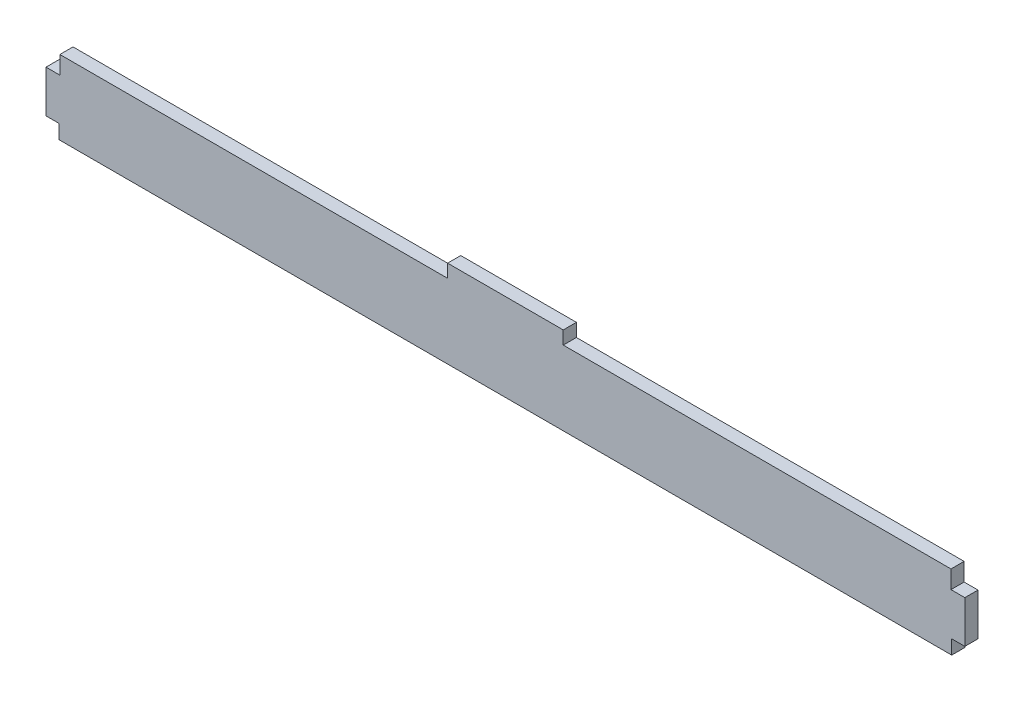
ISO-10303-21;
HEADER;
FILE_DESCRIPTION(('STEP AP214'),'2;1');
FILE_NAME('part.step','',(''),(''),'','','');
FILE_SCHEMA(('AUTOMOTIVE_DESIGN { 1 0 10303 214 1 1 1 1 }'));
ENDSEC;
DATA;
#1=APPLICATION_CONTEXT('core data for automotive mechanical design processes');
#2=APPLICATION_PROTOCOL_DEFINITION('international standard','automotive_design',2000,#1);
#3=PRODUCT_CONTEXT('',#1,'mechanical');
#4=PRODUCT('Part','Part','',(#3));
#5=PRODUCT_RELATED_PRODUCT_CATEGORY('part','',(#4));
#6=PRODUCT_DEFINITION_FORMATION('','',#4);
#7=PRODUCT_DEFINITION_CONTEXT('part definition',#1,'design');
#8=PRODUCT_DEFINITION('design','',#6,#7);
#9=PRODUCT_DEFINITION_SHAPE('','',#8);
#10=(LENGTH_UNIT() NAMED_UNIT(*) SI_UNIT(.MILLI.,.METRE.));
#11=(NAMED_UNIT(*) PLANE_ANGLE_UNIT() SI_UNIT($,.RADIAN.));
#12=(NAMED_UNIT(*) SI_UNIT($,.STERADIAN.) SOLID_ANGLE_UNIT());
#13=UNCERTAINTY_MEASURE_WITH_UNIT(LENGTH_MEASURE(1.E-05),#10,'distance_accuracy_value','');
#14=(GEOMETRIC_REPRESENTATION_CONTEXT(3) GLOBAL_UNCERTAINTY_ASSIGNED_CONTEXT((#13)) GLOBAL_UNIT_ASSIGNED_CONTEXT((#10,
#11,#12)) REPRESENTATION_CONTEXT('',''));
#15=CARTESIAN_POINT('',(0.,0.,0.));
#16=DIRECTION('',(0.,0.,1.));
#17=DIRECTION('',(1.,0.,0.));
#18=AXIS2_PLACEMENT_3D('',#15,#16,#17);
#19=CARTESIAN_POINT('',(111.159880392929,-1.524,1.524));
#20=DIRECTION('',(0.,-1.,0.));
#21=DIRECTION('',(1.,0.,0.));
#22=AXIS2_PLACEMENT_3D('',#19,#20,#21);
#23=PLANE('',#22);
#24=DIRECTION('',(-1.,0.,0.));
#25=VECTOR('',#24,1.);
#26=CARTESIAN_POINT('',(111.159880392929,-1.524,0.));
#27=LINE('',#26,#25);
#28=CARTESIAN_POINT('',(111.159880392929,-1.524,0.));
#29=VERTEX_POINT('',#28);
#30=CARTESIAN_POINT('',(66.2139326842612,-1.524,0.));
#31=VERTEX_POINT('',#30);
#32=EDGE_CURVE('E180',#29,#31,#27,.T.);
#33=ORIENTED_EDGE('',*,*,#32,.T.);
#34=DIRECTION('',(0.,0.,-1.));
#35=VECTOR('',#34,1.);
#36=CARTESIAN_POINT('',(66.2139326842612,-1.524,1.524));
#37=LINE('',#36,#35);
#38=CARTESIAN_POINT('',(66.2139326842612,-1.524,1.524));
#39=VERTEX_POINT('',#38);
#40=EDGE_CURVE('E11',#39,#31,#37,.T.);
#41=ORIENTED_EDGE('',*,*,#40,.F.);
#42=DIRECTION('',(-1.,0.,0.));
#43=VECTOR('',#42,1.);
#44=CARTESIAN_POINT('',(111.159880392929,-1.524,1.524));
#45=LINE('',#44,#43);
#46=CARTESIAN_POINT('',(111.159880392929,-1.524,1.524));
#47=VERTEX_POINT('',#46);
#48=EDGE_CURVE('E210',#47,#39,#45,.T.);
#49=ORIENTED_EDGE('',*,*,#48,.F.);
#50=DIRECTION('',(0.,0.,-1.));
#51=VECTOR('',#50,1.);
#52=CARTESIAN_POINT('',(111.159880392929,-1.524,1.524));
#53=LINE('',#52,#51);
#54=EDGE_CURVE('E176',#47,#29,#53,.T.);
#55=ORIENTED_EDGE('',*,*,#54,.T.);
#56=EDGE_LOOP('',(#33,#41,#49,#55));
#57=FACE_BOUND('',#56,.T.);
#58=ADVANCED_FACE('F36',(#57),#23,.F.);
#59=CARTESIAN_POINT('',(66.2139326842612,-1.524,1.524));
#60=DIRECTION('',(1.,0.,0.));
#61=DIRECTION('',(0.,0.,-1.));
#62=AXIS2_PLACEMENT_3D('',#59,#60,#61);
#63=PLANE('',#62);
#64=DIRECTION('',(0.,-1.,0.));
#65=VECTOR('',#64,1.);
#66=CARTESIAN_POINT('',(66.2139326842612,-1.524,0.));
#67=LINE('',#66,#65);
#68=CARTESIAN_POINT('',(66.2139326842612,-3.59954891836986,0.));
#69=VERTEX_POINT('',#68);
#70=EDGE_CURVE('E183',#31,#69,#67,.T.);
#71=ORIENTED_EDGE('',*,*,#70,.T.);
#72=DIRECTION('',(0.,0.,-1.));
#73=VECTOR('',#72,1.);
#74=CARTESIAN_POINT('',(66.2139326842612,-3.59954891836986,1.524));
#75=LINE('',#74,#73);
#76=CARTESIAN_POINT('',(66.2139326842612,-3.59954891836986,1.524));
#77=VERTEX_POINT('',#76);
#78=EDGE_CURVE('E44',#77,#69,#75,.T.);
#79=ORIENTED_EDGE('',*,*,#78,.F.);
#80=DIRECTION('',(0.,-1.,0.));
#81=VECTOR('',#80,1.);
#82=CARTESIAN_POINT('',(66.2139326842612,-1.524,1.524));
#83=LINE('',#82,#81);
#84=EDGE_CURVE('E119',#39,#77,#83,.T.);
#85=ORIENTED_EDGE('',*,*,#84,.F.);
#86=ORIENTED_EDGE('',*,*,#40,.T.);
#87=EDGE_LOOP('',(#71,#79,#85,#86));
#88=FACE_BOUND('',#87,.T.);
#89=ADVANCED_FACE('F308',(#88),#63,.F.);
#90=CARTESIAN_POINT('',(66.2139326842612,-3.59954891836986,1.524));
#91=DIRECTION('',(0.,-1.,0.));
#92=DIRECTION('',(0.,0.,-1.));
#93=AXIS2_PLACEMENT_3D('',#90,#91,#92);
#94=PLANE('',#93);
#95=DIRECTION('',(-1.,0.,0.));
#96=VECTOR('',#95,1.);
#97=CARTESIAN_POINT('',(66.2139326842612,-3.59954891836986,0.));
#98=LINE('',#97,#96);
#99=CARTESIAN_POINT('',(64.6041495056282,-3.59954891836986,0.));
#100=VERTEX_POINT('',#99);
#101=EDGE_CURVE('E185',#69,#100,#98,.T.);
#102=ORIENTED_EDGE('',*,*,#101,.T.);
#103=DIRECTION('',(0.,0.,-1.));
#104=VECTOR('',#103,1.);
#105=CARTESIAN_POINT('',(64.6041495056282,-3.59954891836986,1.524));
#106=LINE('',#105,#104);
#107=CARTESIAN_POINT('',(64.6041495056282,-3.59954891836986,1.524));
#108=VERTEX_POINT('',#107);
#109=EDGE_CURVE('E241',#108,#100,#106,.T.);
#110=ORIENTED_EDGE('',*,*,#109,.F.);
#111=DIRECTION('',(-1.,0.,0.));
#112=VECTOR('',#111,1.);
#113=CARTESIAN_POINT('',(66.2139326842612,-3.59954891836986,1.524));
#114=LINE('',#113,#112);
#115=EDGE_CURVE('E249',#77,#108,#114,.T.);
#116=ORIENTED_EDGE('',*,*,#115,.F.);
#117=ORIENTED_EDGE('',*,*,#78,.T.);
#118=EDGE_LOOP('',(#102,#110,#116,#117));
#119=FACE_BOUND('',#118,.T.);
#120=ADVANCED_FACE('F247',(#119),#94,.F.);
#121=CARTESIAN_POINT('',(64.6041495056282,-3.59954891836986,1.524));
#122=DIRECTION('',(1.,0.,0.));
#123=DIRECTION('',(0.,1.,0.));
#124=AXIS2_PLACEMENT_3D('',#121,#122,#123);
#125=PLANE('',#124);
#126=DIRECTION('',(0.,-1.,0.));
#127=VECTOR('',#126,1.);
#128=CARTESIAN_POINT('',(64.6041495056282,-3.59954891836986,0.));
#129=LINE('',#128,#127);
#130=CARTESIAN_POINT('',(64.6041495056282,-8.49527832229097,0.));
#131=VERTEX_POINT('',#130);
#132=EDGE_CURVE('E187',#100,#131,#129,.T.);
#133=ORIENTED_EDGE('',*,*,#132,.T.);
#134=DIRECTION('',(0.,0.,-1.));
#135=VECTOR('',#134,1.);
#136=CARTESIAN_POINT('',(64.6041495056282,-8.49527832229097,1.524));
#137=LINE('',#136,#135);
#138=CARTESIAN_POINT('',(64.6041495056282,-8.49527832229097,1.524));
#139=VERTEX_POINT('',#138);
#140=EDGE_CURVE('E238',#139,#131,#137,.T.);
#141=ORIENTED_EDGE('',*,*,#140,.F.);
#142=DIRECTION('',(0.,-1.,0.));
#143=VECTOR('',#142,1.);
#144=CARTESIAN_POINT('',(64.6041495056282,-3.59954891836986,1.524));
#145=LINE('',#144,#143);
#146=EDGE_CURVE('E267',#108,#139,#145,.T.);
#147=ORIENTED_EDGE('',*,*,#146,.F.);
#148=ORIENTED_EDGE('',*,*,#109,.T.);
#149=EDGE_LOOP('',(#133,#141,#147,#148));
#150=FACE_BOUND('',#149,.T.);
#151=ADVANCED_FACE('F258',(#150),#125,.F.);
#152=CARTESIAN_POINT('',(64.6041495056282,-8.49527832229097,1.524));
#153=DIRECTION('',(0.,1.,0.));
#154=DIRECTION('',(0.,0.,1.));
#155=AXIS2_PLACEMENT_3D('',#152,#153,#154);
#156=PLANE('',#155);
#157=DIRECTION('',(1.,0.,0.));
#158=VECTOR('',#157,1.);
#159=CARTESIAN_POINT('',(64.6041495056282,-8.49527832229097,0.));
#160=LINE('',#159,#158);
#161=CARTESIAN_POINT('',(66.1281495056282,-8.49527832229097,0.));
#162=VERTEX_POINT('',#161);
#163=EDGE_CURVE('E189',#131,#162,#160,.T.);
#164=ORIENTED_EDGE('',*,*,#163,.T.);
#165=DIRECTION('',(0.,0.,-1.));
#166=VECTOR('',#165,1.);
#167=CARTESIAN_POINT('',(66.1281495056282,-8.49527832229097,1.524));
#168=LINE('',#167,#166);
#169=CARTESIAN_POINT('',(66.1281495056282,-8.49527832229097,1.524));
#170=VERTEX_POINT('',#169);
#171=EDGE_CURVE('E235',#170,#162,#168,.T.);
#172=ORIENTED_EDGE('',*,*,#171,.F.);
#173=DIRECTION('',(1.,0.,0.));
#174=VECTOR('',#173,1.);
#175=CARTESIAN_POINT('',(64.6041495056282,-8.49527832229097,1.524));
#176=LINE('',#175,#174);
#177=EDGE_CURVE('E264',#139,#170,#176,.T.);
#178=ORIENTED_EDGE('',*,*,#177,.F.);
#179=ORIENTED_EDGE('',*,*,#140,.T.);
#180=EDGE_LOOP('',(#164,#172,#178,#179));
#181=FACE_BOUND('',#180,.T.);
#182=ADVANCED_FACE('F262',(#181),#156,.F.);
#183=CARTESIAN_POINT('',(66.1281495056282,-8.49527832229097,1.524));
#184=DIRECTION('',(1.,0.,0.));
#185=DIRECTION('',(0.,0.,-1.));
#186=AXIS2_PLACEMENT_3D('',#183,#184,#185);
#187=PLANE('',#186);
#188=DIRECTION('',(0.,-1.,0.));
#189=VECTOR('',#188,1.);
#190=CARTESIAN_POINT('',(66.1281495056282,-8.49527832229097,0.));
#191=LINE('',#190,#189);
#192=CARTESIAN_POINT('',(66.1281495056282,-10.1331944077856,0.));
#193=VERTEX_POINT('',#192);
#194=EDGE_CURVE('E191',#162,#193,#191,.T.);
#195=ORIENTED_EDGE('',*,*,#194,.T.);
#196=DIRECTION('',(0.,0.,-1.));
#197=VECTOR('',#196,1.);
#198=CARTESIAN_POINT('',(66.1281495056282,-10.1331944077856,1.524));
#199=LINE('',#198,#197);
#200=CARTESIAN_POINT('',(66.1281495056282,-10.1331944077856,1.524));
#201=VERTEX_POINT('',#200);
#202=EDGE_CURVE('E232',#201,#193,#199,.T.);
#203=ORIENTED_EDGE('',*,*,#202,.F.);
#204=DIRECTION('',(0.,-1.,0.));
#205=VECTOR('',#204,1.);
#206=CARTESIAN_POINT('',(66.1281495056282,-8.49527832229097,1.524));
#207=LINE('',#206,#205);
#208=EDGE_CURVE('E266',#170,#201,#207,.T.);
#209=ORIENTED_EDGE('',*,*,#208,.F.);
#210=ORIENTED_EDGE('',*,*,#171,.T.);
#211=EDGE_LOOP('',(#195,#203,#209,#210));
#212=FACE_BOUND('',#211,.T.);
#213=ADVANCED_FACE('F321',(#212),#187,.F.);
#214=CARTESIAN_POINT('',(66.1281495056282,-10.1331944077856,1.524));
#215=DIRECTION('',(0.,1.,0.));
#216=DIRECTION('',(0.,0.,1.));
#217=AXIS2_PLACEMENT_3D('',#214,#215,#216);
#218=PLANE('',#217);
#219=DIRECTION('',(1.,0.,0.));
#220=VECTOR('',#219,1.);
#221=CARTESIAN_POINT('',(66.1281495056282,-10.1331944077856,0.));
#222=LINE('',#221,#220);
#223=CARTESIAN_POINT('',(169.597449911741,-10.1331944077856,0.));
#224=VERTEX_POINT('',#223);
#225=EDGE_CURVE('E193',#193,#224,#222,.T.);
#226=ORIENTED_EDGE('',*,*,#225,.T.);
#227=DIRECTION('',(0.,0.,-1.));
#228=VECTOR('',#227,1.);
#229=CARTESIAN_POINT('',(169.597449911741,-10.1331944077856,1.524));
#230=LINE('',#229,#228);
#231=CARTESIAN_POINT('',(169.597449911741,-10.1331944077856,1.524));
#232=VERTEX_POINT('',#231);
#233=EDGE_CURVE('E229',#232,#224,#230,.T.);
#234=ORIENTED_EDGE('',*,*,#233,.F.);
#235=DIRECTION('',(1.,0.,0.));
#236=VECTOR('',#235,1.);
#237=CARTESIAN_POINT('',(66.1281495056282,-10.1331944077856,1.524));
#238=LINE('',#237,#236);
#239=EDGE_CURVE('E269',#201,#232,#238,.T.);
#240=ORIENTED_EDGE('',*,*,#239,.F.);
#241=ORIENTED_EDGE('',*,*,#202,.T.);
#242=EDGE_LOOP('',(#226,#234,#240,#241));
#243=FACE_BOUND('',#242,.T.);
#244=ADVANCED_FACE('F324',(#243),#218,.F.);
#245=CARTESIAN_POINT('',(169.597449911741,-8.49527832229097,1.524));
#246=DIRECTION('',(-1.,0.,0.));
#247=DIRECTION('',(0.,0.,1.));
#248=AXIS2_PLACEMENT_3D('',#245,#246,#247);
#249=PLANE('',#248);
#250=DIRECTION('',(0.,1.,0.));
#251=VECTOR('',#250,1.);
#252=CARTESIAN_POINT('',(169.597449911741,-8.49527832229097,0.));
#253=LINE('',#252,#251);
#254=CARTESIAN_POINT('',(169.597449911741,-8.49527832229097,0.));
#255=VERTEX_POINT('',#254);
#256=EDGE_CURVE('E195',#224,#255,#253,.T.);
#257=ORIENTED_EDGE('',*,*,#256,.T.);
#258=DIRECTION('',(0.,0.,-1.));
#259=VECTOR('',#258,1.);
#260=CARTESIAN_POINT('',(169.597449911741,-8.49527832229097,1.524));
#261=LINE('',#260,#259);
#262=CARTESIAN_POINT('',(169.597449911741,-8.49527832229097,1.524));
#263=VERTEX_POINT('',#262);
#264=EDGE_CURVE('E226',#263,#255,#261,.T.);
#265=ORIENTED_EDGE('',*,*,#264,.F.);
#266=DIRECTION('',(0.,1.,0.));
#267=VECTOR('',#266,1.);
#268=CARTESIAN_POINT('',(169.597449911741,-8.49527832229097,1.524));
#269=LINE('',#268,#267);
#270=EDGE_CURVE('E275',#232,#263,#269,.T.);
#271=ORIENTED_EDGE('',*,*,#270,.F.);
#272=ORIENTED_EDGE('',*,*,#233,.T.);
#273=EDGE_LOOP('',(#257,#265,#271,#272));
#274=FACE_BOUND('',#273,.T.);
#275=ADVANCED_FACE('F328',(#274),#249,.F.);
#276=CARTESIAN_POINT('',(171.121449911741,-8.49527832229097,1.524));
#277=DIRECTION('',(0.,1.,0.));
#278=DIRECTION('',(0.,0.,1.));
#279=AXIS2_PLACEMENT_3D('',#276,#277,#278);
#280=PLANE('',#279);
#281=DIRECTION('',(1.,0.,0.));
#282=VECTOR('',#281,1.);
#283=CARTESIAN_POINT('',(171.121449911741,-8.49527832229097,0.));
#284=LINE('',#283,#282);
#285=CARTESIAN_POINT('',(171.121449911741,-8.49527832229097,0.));
#286=VERTEX_POINT('',#285);
#287=EDGE_CURVE('E197',#255,#286,#284,.T.);
#288=ORIENTED_EDGE('',*,*,#287,.T.);
#289=DIRECTION('',(0.,0.,-1.));
#290=VECTOR('',#289,1.);
#291=CARTESIAN_POINT('',(171.121449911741,-8.49527832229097,1.524));
#292=LINE('',#291,#290);
#293=CARTESIAN_POINT('',(171.121449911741,-8.49527832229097,1.524));
#294=VERTEX_POINT('',#293);
#295=EDGE_CURVE('E223',#294,#286,#292,.T.);
#296=ORIENTED_EDGE('',*,*,#295,.F.);
#297=DIRECTION('',(1.,0.,0.));
#298=VECTOR('',#297,1.);
#299=CARTESIAN_POINT('',(171.121449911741,-8.49527832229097,1.524));
#300=LINE('',#299,#298);
#301=EDGE_CURVE('E277',#263,#294,#300,.T.);
#302=ORIENTED_EDGE('',*,*,#301,.F.);
#303=ORIENTED_EDGE('',*,*,#264,.T.);
#304=EDGE_LOOP('',(#288,#296,#302,#303));
#305=FACE_BOUND('',#304,.T.);
#306=ADVANCED_FACE('F332',(#305),#280,.F.);
#307=CARTESIAN_POINT('',(171.121449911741,-3.59954891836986,1.524));
#308=DIRECTION('',(-1.,0.,0.));
#309=DIRECTION('',(0.,0.,1.));
#310=AXIS2_PLACEMENT_3D('',#307,#308,#309);
#311=PLANE('',#310);
#312=DIRECTION('',(0.,1.,0.));
#313=VECTOR('',#312,1.);
#314=CARTESIAN_POINT('',(171.121449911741,-3.59954891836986,0.));
#315=LINE('',#314,#313);
#316=CARTESIAN_POINT('',(171.121449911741,-3.59954891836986,0.));
#317=VERTEX_POINT('',#316);
#318=EDGE_CURVE('E199',#286,#317,#315,.T.);
#319=ORIENTED_EDGE('',*,*,#318,.T.);
#320=DIRECTION('',(0.,0.,-1.));
#321=VECTOR('',#320,1.);
#322=CARTESIAN_POINT('',(171.121449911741,-3.59954891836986,1.524));
#323=LINE('',#322,#321);
#324=CARTESIAN_POINT('',(171.121449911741,-3.59954891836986,1.524));
#325=VERTEX_POINT('',#324);
#326=EDGE_CURVE('E220',#325,#317,#323,.T.);
#327=ORIENTED_EDGE('',*,*,#326,.F.);
#328=DIRECTION('',(0.,1.,0.));
#329=VECTOR('',#328,1.);
#330=CARTESIAN_POINT('',(171.121449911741,-3.59954891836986,1.524));
#331=LINE('',#330,#329);
#332=EDGE_CURVE('E279',#294,#325,#331,.T.);
#333=ORIENTED_EDGE('',*,*,#332,.F.);
#334=ORIENTED_EDGE('',*,*,#295,.T.);
#335=EDGE_LOOP('',(#319,#327,#333,#334));
#336=FACE_BOUND('',#335,.T.);
#337=ADVANCED_FACE('F336',(#336),#311,.F.);
#338=CARTESIAN_POINT('',(169.511666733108,-3.59954891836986,1.524));
#339=DIRECTION('',(0.,-1.,0.));
#340=DIRECTION('',(0.,0.,-1.));
#341=AXIS2_PLACEMENT_3D('',#338,#339,#340);
#342=PLANE('',#341);
#343=DIRECTION('',(-1.,0.,0.));
#344=VECTOR('',#343,1.);
#345=CARTESIAN_POINT('',(169.511666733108,-3.59954891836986,0.));
#346=LINE('',#345,#344);
#347=CARTESIAN_POINT('',(169.511666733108,-3.59954891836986,0.));
#348=VERTEX_POINT('',#347);
#349=EDGE_CURVE('E201',#317,#348,#346,.T.);
#350=ORIENTED_EDGE('',*,*,#349,.T.);
#351=DIRECTION('',(0.,0.,-1.));
#352=VECTOR('',#351,1.);
#353=CARTESIAN_POINT('',(169.511666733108,-3.59954891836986,1.524));
#354=LINE('',#353,#352);
#355=CARTESIAN_POINT('',(169.511666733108,-3.59954891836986,1.524));
#356=VERTEX_POINT('',#355);
#357=EDGE_CURVE('E217',#356,#348,#354,.T.);
#358=ORIENTED_EDGE('',*,*,#357,.F.);
#359=DIRECTION('',(-1.,0.,0.));
#360=VECTOR('',#359,1.);
#361=CARTESIAN_POINT('',(169.511666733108,-3.59954891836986,1.524));
#362=LINE('',#361,#360);
#363=EDGE_CURVE('E281',#325,#356,#362,.T.);
#364=ORIENTED_EDGE('',*,*,#363,.F.);
#365=ORIENTED_EDGE('',*,*,#326,.T.);
#366=EDGE_LOOP('',(#350,#358,#364,#365));
#367=FACE_BOUND('',#366,.T.);
#368=ADVANCED_FACE('F340',(#367),#342,.F.);
#369=CARTESIAN_POINT('',(169.511666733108,-1.524,1.524));
#370=DIRECTION('',(-1.,0.,0.));
#371=DIRECTION('',(0.,0.,1.));
#372=AXIS2_PLACEMENT_3D('',#369,#370,#371);
#373=PLANE('',#372);
#374=DIRECTION('',(0.,1.,0.));
#375=VECTOR('',#374,1.);
#376=CARTESIAN_POINT('',(169.511666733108,-1.524,0.));
#377=LINE('',#376,#375);
#378=CARTESIAN_POINT('',(169.511666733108,-1.524,0.));
#379=VERTEX_POINT('',#378);
#380=EDGE_CURVE('E203',#348,#379,#377,.T.);
#381=ORIENTED_EDGE('',*,*,#380,.T.);
#382=DIRECTION('',(0.,0.,-1.));
#383=VECTOR('',#382,1.);
#384=CARTESIAN_POINT('',(169.511666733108,-1.524,1.524));
#385=LINE('',#384,#383);
#386=CARTESIAN_POINT('',(169.511666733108,-1.524,1.524));
#387=VERTEX_POINT('',#386);
#388=EDGE_CURVE('E214',#387,#379,#385,.T.);
#389=ORIENTED_EDGE('',*,*,#388,.F.);
#390=DIRECTION('',(0.,1.,0.));
#391=VECTOR('',#390,1.);
#392=CARTESIAN_POINT('',(169.511666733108,-1.524,1.524));
#393=LINE('',#392,#391);
#394=EDGE_CURVE('E283',#356,#387,#393,.T.);
#395=ORIENTED_EDGE('',*,*,#394,.F.);
#396=ORIENTED_EDGE('',*,*,#357,.T.);
#397=EDGE_LOOP('',(#381,#389,#395,#396));
#398=FACE_BOUND('',#397,.T.);
#399=ADVANCED_FACE('F289',(#398),#373,.F.);
#400=CARTESIAN_POINT('',(124.56571902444,-1.524,1.524));
#401=DIRECTION('',(0.,-1.,0.));
#402=DIRECTION('',(0.,0.,-1.));
#403=AXIS2_PLACEMENT_3D('',#400,#401,#402);
#404=PLANE('',#403);
#405=DIRECTION('',(-1.,0.,0.));
#406=VECTOR('',#405,1.);
#407=CARTESIAN_POINT('',(124.56571902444,-1.524,0.));
#408=LINE('',#407,#406);
#409=CARTESIAN_POINT('',(124.56571902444,-1.524,0.));
#410=VERTEX_POINT('',#409);
#411=EDGE_CURVE('E205',#379,#410,#408,.T.);
#412=ORIENTED_EDGE('',*,*,#411,.T.);
#413=DIRECTION('',(0.,0.,-1.));
#414=VECTOR('',#413,1.);
#415=CARTESIAN_POINT('',(124.56571902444,-1.524,1.524));
#416=LINE('',#415,#414);
#417=CARTESIAN_POINT('',(124.56571902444,-1.524,1.524));
#418=VERTEX_POINT('',#417);
#419=EDGE_CURVE('E171',#418,#410,#416,.T.);
#420=ORIENTED_EDGE('',*,*,#419,.F.);
#421=DIRECTION('',(-1.,0.,0.));
#422=VECTOR('',#421,1.);
#423=CARTESIAN_POINT('',(124.56571902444,-1.524,1.524));
#424=LINE('',#423,#422);
#425=EDGE_CURVE('E162',#387,#418,#424,.T.);
#426=ORIENTED_EDGE('',*,*,#425,.F.);
#427=ORIENTED_EDGE('',*,*,#388,.T.);
#428=EDGE_LOOP('',(#412,#420,#426,#427));
#429=FACE_BOUND('',#428,.T.);
#430=ADVANCED_FACE('F293',(#429),#404,.F.);
#431=CARTESIAN_POINT('',(124.56571902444,0.,1.524));
#432=DIRECTION('',(-1.,0.,0.));
#433=DIRECTION('',(0.,0.,1.));
#434=AXIS2_PLACEMENT_3D('',#431,#432,#433);
#435=PLANE('',#434);
#436=DIRECTION('',(0.,1.,0.));
#437=VECTOR('',#436,1.);
#438=CARTESIAN_POINT('',(124.56571902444,0.,0.));
#439=LINE('',#438,#437);
#440=CARTESIAN_POINT('',(124.56571902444,0.,0.));
#441=VERTEX_POINT('',#440);
#442=EDGE_CURVE('E170',#410,#441,#439,.T.);
#443=ORIENTED_EDGE('',*,*,#442,.T.);
#444=DIRECTION('',(0.,0.,-1.));
#445=VECTOR('',#444,1.);
#446=CARTESIAN_POINT('',(124.56571902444,0.,1.524));
#447=LINE('',#446,#445);
#448=CARTESIAN_POINT('',(124.56571902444,0.,1.524));
#449=VERTEX_POINT('',#448);
#450=EDGE_CURVE('E167',#449,#441,#447,.T.);
#451=ORIENTED_EDGE('',*,*,#450,.F.);
#452=DIRECTION('',(0.,1.,0.));
#453=VECTOR('',#452,1.);
#454=CARTESIAN_POINT('',(124.56571902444,0.,1.524));
#455=LINE('',#454,#453);
#456=EDGE_CURVE('E156',#418,#449,#455,.T.);
#457=ORIENTED_EDGE('',*,*,#456,.F.);
#458=ORIENTED_EDGE('',*,*,#419,.T.);
#459=EDGE_LOOP('',(#443,#451,#457,#458));
#460=FACE_BOUND('',#459,.T.);
#461=ADVANCED_FACE('F168',(#460),#435,.F.);
#462=CARTESIAN_POINT('',(111.159880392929,0.,1.524));
#463=DIRECTION('',(0.,-1.,0.));
#464=DIRECTION('',(1.,0.,0.));
#465=AXIS2_PLACEMENT_3D('',#462,#463,#464);
#466=PLANE('',#465);
#467=DIRECTION('',(-1.,0.,0.));
#468=VECTOR('',#467,1.);
#469=CARTESIAN_POINT('',(111.159880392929,0.,0.));
#470=LINE('',#469,#468);
#471=CARTESIAN_POINT('',(111.159880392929,0.,0.));
#472=VERTEX_POINT('',#471);
#473=EDGE_CURVE('E105',#441,#472,#470,.T.);
#474=ORIENTED_EDGE('',*,*,#473,.T.);
#475=DIRECTION('',(0.,0.,-1.));
#476=VECTOR('',#475,1.);
#477=CARTESIAN_POINT('',(111.159880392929,0.,1.524));
#478=LINE('',#477,#476);
#479=CARTESIAN_POINT('',(111.159880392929,0.,1.524));
#480=VERTEX_POINT('',#479);
#481=EDGE_CURVE('E172',#480,#472,#478,.T.);
#482=ORIENTED_EDGE('',*,*,#481,.F.);
#483=DIRECTION('',(-1.,0.,0.));
#484=VECTOR('',#483,1.);
#485=CARTESIAN_POINT('',(111.159880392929,0.,1.524));
#486=LINE('',#485,#484);
#487=EDGE_CURVE('E160',#449,#480,#486,.T.);
#488=ORIENTED_EDGE('',*,*,#487,.F.);
#489=ORIENTED_EDGE('',*,*,#450,.T.);
#490=EDGE_LOOP('',(#474,#482,#488,#489));
#491=FACE_BOUND('',#490,.T.);
#492=ADVANCED_FACE('F174',(#491),#466,.F.);
#493=CARTESIAN_POINT('',(111.159880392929,-1.524,1.524));
#494=DIRECTION('',(1.,0.,0.));
#495=DIRECTION('',(0.,0.,-1.));
#496=AXIS2_PLACEMENT_3D('',#493,#494,#495);
#497=PLANE('',#496);
#498=DIRECTION('',(0.,-1.,0.));
#499=VECTOR('',#498,1.);
#500=CARTESIAN_POINT('',(111.159880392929,-1.524,0.));
#501=LINE('',#500,#499);
#502=EDGE_CURVE('E111',#472,#29,#501,.T.);
#503=ORIENTED_EDGE('',*,*,#502,.T.);
#504=ORIENTED_EDGE('',*,*,#54,.F.);
#505=DIRECTION('',(0.,-1.,0.));
#506=VECTOR('',#505,1.);
#507=CARTESIAN_POINT('',(111.159880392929,-1.524,1.524));
#508=LINE('',#507,#506);
#509=EDGE_CURVE('E52',#480,#47,#508,.T.);
#510=ORIENTED_EDGE('',*,*,#509,.F.);
#511=ORIENTED_EDGE('',*,*,#481,.T.);
#512=EDGE_LOOP('',(#503,#504,#510,#511));
#513=FACE_BOUND('',#512,.T.);
#514=ADVANCED_FACE('F297',(#513),#497,.F.);
#515=CARTESIAN_POINT('',(0.,0.,1.524));
#516=DIRECTION('',(0.,0.,1.));
#517=DIRECTION('',(1.,0.,0.));
#518=AXIS2_PLACEMENT_3D('',#515,#516,#517);
#519=PLANE('',#518);
#520=ORIENTED_EDGE('',*,*,#48,.T.);
#521=ORIENTED_EDGE('',*,*,#84,.T.);
#522=ORIENTED_EDGE('',*,*,#115,.T.);
#523=ORIENTED_EDGE('',*,*,#146,.T.);
#524=ORIENTED_EDGE('',*,*,#177,.T.);
#525=ORIENTED_EDGE('',*,*,#208,.T.);
#526=ORIENTED_EDGE('',*,*,#239,.T.);
#527=ORIENTED_EDGE('',*,*,#270,.T.);
#528=ORIENTED_EDGE('',*,*,#301,.T.);
#529=ORIENTED_EDGE('',*,*,#332,.T.);
#530=ORIENTED_EDGE('',*,*,#363,.T.);
#531=ORIENTED_EDGE('',*,*,#394,.T.);
#532=ORIENTED_EDGE('',*,*,#425,.T.);
#533=ORIENTED_EDGE('',*,*,#456,.T.);
#534=ORIENTED_EDGE('',*,*,#487,.T.);
#535=ORIENTED_EDGE('',*,*,#509,.T.);
#536=EDGE_LOOP('',(#520,#521,#522,#523,#524,#525,#526,#527,#528,#529,#530,#531,#532,#533,#534,#535));
#537=FACE_BOUND('',#536,.T.);
#538=ADVANCED_FACE('F158',(#537),#519,.T.);
#539=CARTESIAN_POINT('',(0.,0.,0.));
#540=DIRECTION('',(0.,0.,1.));
#541=DIRECTION('',(1.,0.,0.));
#542=AXIS2_PLACEMENT_3D('',#539,#540,#541);
#543=PLANE('',#542);
#544=ORIENTED_EDGE('',*,*,#32,.F.);
#545=ORIENTED_EDGE('',*,*,#502,.F.);
#546=ORIENTED_EDGE('',*,*,#473,.F.);
#547=ORIENTED_EDGE('',*,*,#442,.F.);
#548=ORIENTED_EDGE('',*,*,#411,.F.);
#549=ORIENTED_EDGE('',*,*,#380,.F.);
#550=ORIENTED_EDGE('',*,*,#349,.F.);
#551=ORIENTED_EDGE('',*,*,#318,.F.);
#552=ORIENTED_EDGE('',*,*,#287,.F.);
#553=ORIENTED_EDGE('',*,*,#256,.F.);
#554=ORIENTED_EDGE('',*,*,#225,.F.);
#555=ORIENTED_EDGE('',*,*,#194,.F.);
#556=ORIENTED_EDGE('',*,*,#163,.F.);
#557=ORIENTED_EDGE('',*,*,#132,.F.);
#558=ORIENTED_EDGE('',*,*,#101,.F.);
#559=ORIENTED_EDGE('',*,*,#70,.F.);
#560=EDGE_LOOP('',(#544,#545,#546,#547,#548,#549,#550,#551,#552,#553,#554,#555,#556,#557,#558,#559));
#561=FACE_BOUND('',#560,.T.);
#562=ADVANCED_FACE('F253',(#561),#543,.F.);
#563=CLOSED_SHELL('',(#58,#89,#120,#151,#182,#213,#244,#275,#306,#337,#368,#399,#430,#461,#492,
#514,#538,#562));
#564=MANIFOLD_SOLID_BREP('B2',#563);
#565=ADVANCED_BREP_SHAPE_REPRESENTATION('',(#18,#564),#14);
#566=SHAPE_DEFINITION_REPRESENTATION(#9,#565);
ENDSEC;
END-ISO-10303-21;
